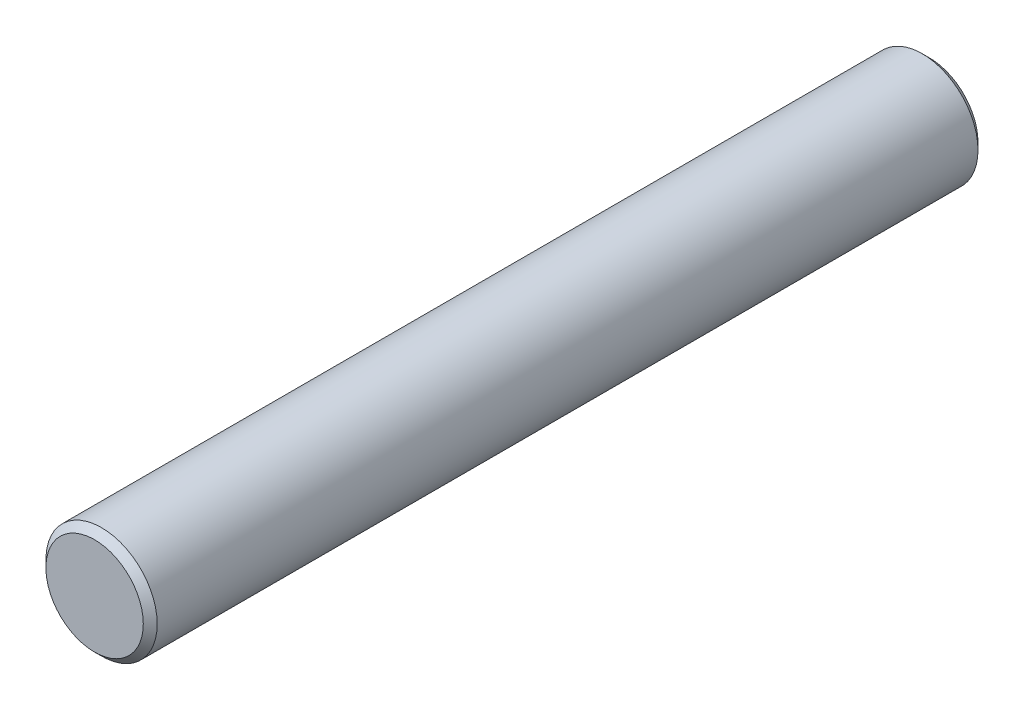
from build123d import *

# Parameters (mm, degrees)
ESQUISSE1_R          = 8
BASE_EXTRUSION_DEPTH = 120
CHANFREIN1_SIZE      = 1


with BuildPart() as part:
    # Esquisse1 → Base-Extrusion (new body)
    with BuildSketch(Plane.XY):
        Circle(ESQUISSE1_R)
    extrude(amount=BASE_EXTRUSION_DEPTH)

    # Chanfrein1
    chanfrein1_edges = [part.edges().sort_by_distance(p)[0] for p in [
        (-8, 0, 0),
        (-8, 0, 120),
    ]]
    chamfer(chanfrein1_edges, length=CHANFREIN1_SIZE)


solid = part.part
